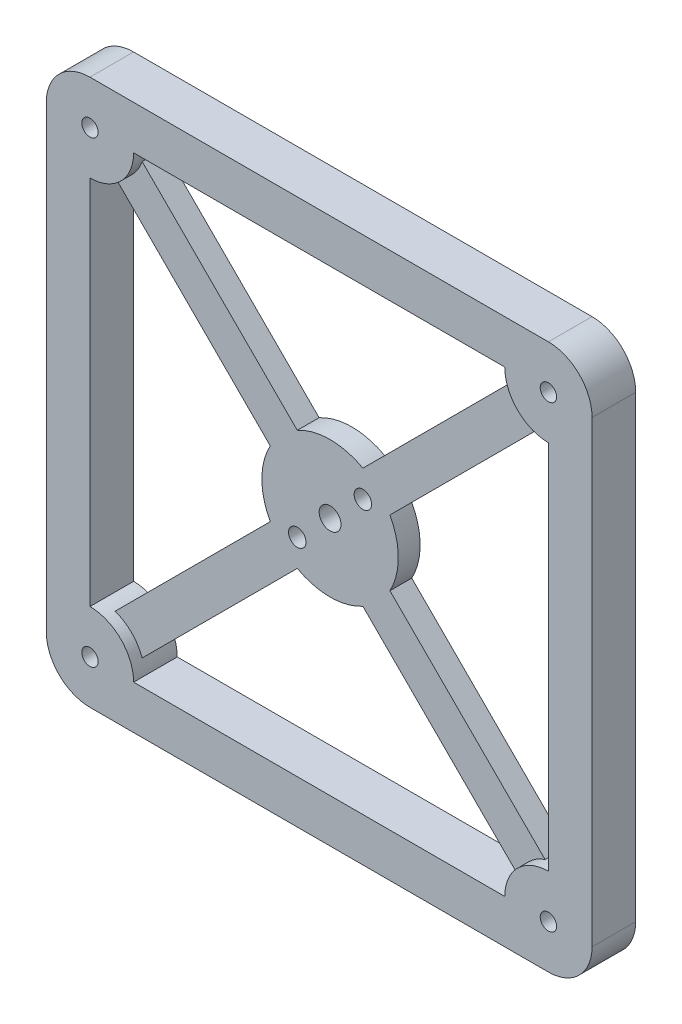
ISO-10303-21;
HEADER;
FILE_DESCRIPTION(('STEP AP214'),'2;1');
FILE_NAME('part.step','',(''),(''),'','','');
FILE_SCHEMA(('AUTOMOTIVE_DESIGN { 1 0 10303 214 1 1 1 1 }'));
ENDSEC;
DATA;
#1=APPLICATION_CONTEXT('core data for automotive mechanical design processes');
#2=APPLICATION_PROTOCOL_DEFINITION('international standard','automotive_design',2000,#1);
#3=PRODUCT_CONTEXT('',#1,'mechanical');
#4=PRODUCT('Part','Part','',(#3));
#5=PRODUCT_RELATED_PRODUCT_CATEGORY('part','',(#4));
#6=PRODUCT_DEFINITION_FORMATION('','',#4);
#7=PRODUCT_DEFINITION_CONTEXT('part definition',#1,'design');
#8=PRODUCT_DEFINITION('design','',#6,#7);
#9=PRODUCT_DEFINITION_SHAPE('','',#8);
#10=(LENGTH_UNIT() NAMED_UNIT(*) SI_UNIT(.MILLI.,.METRE.));
#11=(NAMED_UNIT(*) PLANE_ANGLE_UNIT() SI_UNIT($,.RADIAN.));
#12=(NAMED_UNIT(*) SI_UNIT($,.STERADIAN.) SOLID_ANGLE_UNIT());
#13=UNCERTAINTY_MEASURE_WITH_UNIT(LENGTH_MEASURE(1.E-05),#10,'distance_accuracy_value','');
#14=(GEOMETRIC_REPRESENTATION_CONTEXT(3) GLOBAL_UNCERTAINTY_ASSIGNED_CONTEXT((#13)) GLOBAL_UNIT_ASSIGNED_CONTEXT((#10,
#11,#12)) REPRESENTATION_CONTEXT('',''));
#15=CARTESIAN_POINT('',(0.,0.,0.));
#16=DIRECTION('',(0.,0.,1.));
#17=DIRECTION('',(1.,0.,0.));
#18=AXIS2_PLACEMENT_3D('',#15,#16,#17);
#19=CARTESIAN_POINT('',(-6.01040764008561,-6.01040764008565,8.));
#20=DIRECTION('',(0.,0.,-1.));
#21=DIRECTION('',(-1.,0.,0.));
#22=AXIS2_PLACEMENT_3D('',#19,#20,#21);
#23=CYLINDRICAL_SURFACE('',#22,1.59999999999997);
#24=CARTESIAN_POINT('',(-6.01040764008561,-6.01040764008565,2.));
#25=DIRECTION('',(0.,0.,-1.));
#26=DIRECTION('',(-1.,0.,0.));
#27=AXIS2_PLACEMENT_3D('',#24,#25,#26);
#28=CIRCLE('',#27,1.59999999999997);
#29=CARTESIAN_POINT('',(-7.61040764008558,-6.01040764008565,2.));
#30=VERTEX_POINT('',#29);
#31=EDGE_CURVE('E1020',#30,#30,#28,.F.);
#32=ORIENTED_EDGE('',*,*,#31,.F.);
#33=EDGE_LOOP('',(#32));
#34=FACE_BOUND('',#33,.T.);
#35=CARTESIAN_POINT('',(-6.01040764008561,-6.01040764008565,6.));
#36=DIRECTION('',(0.,0.,-1.));
#37=DIRECTION('',(-1.,0.,0.));
#38=AXIS2_PLACEMENT_3D('',#35,#36,#37);
#39=CIRCLE('',#38,1.59999999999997);
#40=CARTESIAN_POINT('',(-7.61040764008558,-6.01040764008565,6.));
#41=VERTEX_POINT('',#40);
#42=EDGE_CURVE('E1140',#41,#41,#39,.F.);
#43=ORIENTED_EDGE('',*,*,#42,.T.);
#44=EDGE_LOOP('',(#43));
#45=FACE_BOUND('',#44,.T.);
#46=ADVANCED_FACE('F181',(#34,#45),#23,.F.);
#47=CARTESIAN_POINT('',(0.,0.,8.));
#48=DIRECTION('',(0.,0.,-1.));
#49=DIRECTION('',(-1.,0.,0.));
#50=AXIS2_PLACEMENT_3D('',#47,#48,#49);
#51=CYLINDRICAL_SURFACE('',#50,2.);
#52=CARTESIAN_POINT('',(0.,0.,2.));
#53=DIRECTION('',(0.,0.,-1.));
#54=DIRECTION('',(-1.,0.,0.));
#55=AXIS2_PLACEMENT_3D('',#52,#53,#54);
#56=CIRCLE('',#55,2.);
#57=CARTESIAN_POINT('',(-1.99999999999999,0.,2.));
#58=VERTEX_POINT('',#57);
#59=EDGE_CURVE('E1023',#58,#58,#56,.F.);
#60=ORIENTED_EDGE('',*,*,#59,.F.);
#61=EDGE_LOOP('',(#60));
#62=FACE_BOUND('',#61,.T.);
#63=CARTESIAN_POINT('',(0.,0.,6.));
#64=DIRECTION('',(0.,0.,-1.));
#65=DIRECTION('',(-1.,0.,0.));
#66=AXIS2_PLACEMENT_3D('',#63,#64,#65);
#67=CIRCLE('',#66,2.);
#68=CARTESIAN_POINT('',(-1.99999999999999,0.,6.));
#69=VERTEX_POINT('',#68);
#70=EDGE_CURVE('E1143',#69,#69,#67,.F.);
#71=ORIENTED_EDGE('',*,*,#70,.T.);
#72=EDGE_LOOP('',(#71));
#73=FACE_BOUND('',#72,.T.);
#74=ADVANCED_FACE('F552',(#62,#73),#51,.F.);
#75=CARTESIAN_POINT('',(6.01040764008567,6.01040764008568,8.));
#76=DIRECTION('',(0.,0.,-1.));
#77=DIRECTION('',(-1.,0.,0.));
#78=AXIS2_PLACEMENT_3D('',#75,#76,#77);
#79=CYLINDRICAL_SURFACE('',#78,1.59999999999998);
#80=CARTESIAN_POINT('',(6.01040764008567,6.01040764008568,2.));
#81=DIRECTION('',(0.,0.,-1.));
#82=DIRECTION('',(-1.,0.,0.));
#83=AXIS2_PLACEMENT_3D('',#80,#81,#82);
#84=CIRCLE('',#83,1.59999999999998);
#85=CARTESIAN_POINT('',(4.41040764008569,6.01040764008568,2.));
#86=VERTEX_POINT('',#85);
#87=EDGE_CURVE('E981',#86,#86,#84,.F.);
#88=ORIENTED_EDGE('',*,*,#87,.F.);
#89=EDGE_LOOP('',(#88));
#90=FACE_BOUND('',#89,.T.);
#91=CARTESIAN_POINT('',(6.01040764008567,6.01040764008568,6.));
#92=DIRECTION('',(0.,0.,-1.));
#93=DIRECTION('',(-1.,0.,0.));
#94=AXIS2_PLACEMENT_3D('',#91,#92,#93);
#95=CIRCLE('',#94,1.59999999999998);
#96=CARTESIAN_POINT('',(4.41040764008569,6.01040764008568,6.));
#97=VERTEX_POINT('',#96);
#98=EDGE_CURVE('E1137',#97,#97,#95,.F.);
#99=ORIENTED_EDGE('',*,*,#98,.T.);
#100=EDGE_LOOP('',(#99));
#101=FACE_BOUND('',#100,.T.);
#102=ADVANCED_FACE('F558',(#90,#101),#79,.F.);
#103=CARTESIAN_POINT('',(2.47487373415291,-2.47487373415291,8.));
#104=DIRECTION('',(0.707106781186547,-0.707106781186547,0.));
#105=DIRECTION('',(0.707106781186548,0.707106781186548,0.));
#106=AXIS2_PLACEMENT_3D('',#103,#104,#105);
#107=PLANE('',#106);
#108=DIRECTION('',(0.,0.,-1.));
#109=VECTOR('',#108,1.);
#110=CARTESIAN_POINT('',(39.388126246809,34.4383787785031,8.));
#111=LINE('',#110,#109);
#112=CARTESIAN_POINT('',(39.388126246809,34.4383787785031,6.));
#113=VERTEX_POINT('',#112);
#114=CARTESIAN_POINT('',(39.388126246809,34.4383787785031,2.));
#115=VERTEX_POINT('',#114);
#116=EDGE_CURVE('E441',#113,#115,#111,.T.);
#117=ORIENTED_EDGE('',*,*,#116,.F.);
#118=DIRECTION('',(-0.707106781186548,-0.707106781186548,0.));
#119=VECTOR('',#118,1.);
#120=CARTESIAN_POINT('',(2.47487373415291,-2.47487373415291,6.));
#121=LINE('',#120,#119);
#122=CARTESIAN_POINT('',(10.9601551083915,6.01040764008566,6.));
#123=VERTEX_POINT('',#122);
#124=EDGE_CURVE('E396',#113,#123,#121,.T.);
#125=ORIENTED_EDGE('',*,*,#124,.T.);
#126=DIRECTION('',(0.,0.,-1.));
#127=VECTOR('',#126,1.);
#128=CARTESIAN_POINT('',(10.9601551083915,6.01040764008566,8.));
#129=LINE('',#128,#127);
#130=CARTESIAN_POINT('',(10.9601551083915,6.01040764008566,2.));
#131=VERTEX_POINT('',#130);
#132=EDGE_CURVE('E443',#123,#131,#129,.T.);
#133=ORIENTED_EDGE('',*,*,#132,.T.);
#134=DIRECTION('',(-0.707106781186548,-0.707106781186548,0.));
#135=VECTOR('',#134,1.);
#136=CARTESIAN_POINT('',(2.47487373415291,-2.47487373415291,2.));
#137=LINE('',#136,#135);
#138=EDGE_CURVE('E991',#115,#131,#137,.T.);
#139=ORIENTED_EDGE('',*,*,#138,.F.);
#140=EDGE_LOOP('',(#117,#125,#133,#139));
#141=FACE_BOUND('',#140,.T.);
#142=ADVANCED_FACE('F722',(#141),#107,.T.);
#143=CARTESIAN_POINT('',(0.,0.,8.));
#144=DIRECTION('',(0.,0.,-1.));
#145=DIRECTION('',(-1.,0.,0.));
#146=AXIS2_PLACEMENT_3D('',#143,#144,#145);
#147=CYLINDRICAL_SURFACE('',#146,12.5);
#148=ORIENTED_EDGE('',*,*,#132,.F.);
#149=CARTESIAN_POINT('',(0.,0.,6.));
#150=DIRECTION('',(0.,0.,-1.));
#151=DIRECTION('',(-1.,0.,0.));
#152=AXIS2_PLACEMENT_3D('',#149,#150,#151);
#153=CIRCLE('',#152,12.5);
#154=CARTESIAN_POINT('',(10.9601551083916,-6.01040764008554,6.));
#155=VERTEX_POINT('',#154);
#156=EDGE_CURVE('E1135',#123,#155,#153,.T.);
#157=ORIENTED_EDGE('',*,*,#156,.T.);
#158=DIRECTION('',(0.,0.,-1.));
#159=VECTOR('',#158,1.);
#160=CARTESIAN_POINT('',(10.9601551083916,-6.01040764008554,8.));
#161=LINE('',#160,#159);
#162=CARTESIAN_POINT('',(10.9601551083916,-6.01040764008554,2.));
#163=VERTEX_POINT('',#162);
#164=EDGE_CURVE('E445',#155,#163,#161,.T.);
#165=ORIENTED_EDGE('',*,*,#164,.T.);
#166=CARTESIAN_POINT('',(0.,0.,2.));
#167=DIRECTION('',(0.,0.,-1.));
#168=DIRECTION('',(-1.,0.,0.));
#169=AXIS2_PLACEMENT_3D('',#166,#167,#168);
#170=CIRCLE('',#169,12.5);
#171=EDGE_CURVE('E980',#131,#163,#170,.T.);
#172=ORIENTED_EDGE('',*,*,#171,.F.);
#173=EDGE_LOOP('',(#148,#157,#165,#172));
#174=FACE_BOUND('',#173,.T.);
#175=ADVANCED_FACE('F731',(#174),#147,.T.);
#176=CARTESIAN_POINT('',(2.47487373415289,2.47487373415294,8.));
#177=DIRECTION('',(0.70710678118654,0.707106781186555,0.));
#178=DIRECTION('',(-0.707106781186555,0.70710678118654,0.));
#179=AXIS2_PLACEMENT_3D('',#176,#177,#178);
#180=PLANE('',#179);
#181=ORIENTED_EDGE('',*,*,#164,.F.);
#182=DIRECTION('',(0.707106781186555,-0.70710678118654,0.));
#183=VECTOR('',#182,1.);
#184=CARTESIAN_POINT('',(2.47487373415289,2.47487373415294,6.));
#185=LINE('',#184,#183);
#186=CARTESIAN_POINT('',(39.3881262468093,-34.4383787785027,6.));
#187=VERTEX_POINT('',#186);
#188=EDGE_CURVE('E1132',#155,#187,#185,.T.);
#189=ORIENTED_EDGE('',*,*,#188,.T.);
#190=DIRECTION('',(0.,0.,-1.));
#191=VECTOR('',#190,1.);
#192=CARTESIAN_POINT('',(39.3881262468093,-34.4383787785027,8.));
#193=LINE('',#192,#191);
#194=CARTESIAN_POINT('',(39.3881262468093,-34.4383787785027,2.));
#195=VERTEX_POINT('',#194);
#196=EDGE_CURVE('E429',#187,#195,#193,.T.);
#197=ORIENTED_EDGE('',*,*,#196,.T.);
#198=DIRECTION('',(0.707106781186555,-0.70710678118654,0.));
#199=VECTOR('',#198,1.);
#200=CARTESIAN_POINT('',(2.47487373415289,2.47487373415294,2.));
#201=LINE('',#200,#199);
#202=EDGE_CURVE('E990',#163,#195,#201,.T.);
#203=ORIENTED_EDGE('',*,*,#202,.F.);
#204=EDGE_LOOP('',(#181,#189,#197,#203));
#205=FACE_BOUND('',#204,.T.);
#206=ADVANCED_FACE('F741',(#205),#180,.T.);
#207=CARTESIAN_POINT('',(-2.47487373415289,-2.47487373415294,8.));
#208=DIRECTION('',(-0.70710678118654,-0.707106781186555,0.));
#209=DIRECTION('',(0.707106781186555,-0.70710678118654,0.));
#210=AXIS2_PLACEMENT_3D('',#207,#208,#209);
#211=PLANE('',#210);
#212=DIRECTION('',(0.,0.,-1.));
#213=VECTOR('',#212,1.);
#214=CARTESIAN_POINT('',(34.4383787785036,-39.3881262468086,8.));
#215=LINE('',#214,#213);
#216=CARTESIAN_POINT('',(34.4383787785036,-39.3881262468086,6.));
#217=VERTEX_POINT('',#216);
#218=CARTESIAN_POINT('',(34.4383787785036,-39.3881262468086,2.));
#219=VERTEX_POINT('',#218);
#220=EDGE_CURVE('E1060',#217,#219,#215,.T.);
#221=ORIENTED_EDGE('',*,*,#220,.F.);
#222=DIRECTION('',(-0.707106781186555,0.70710678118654,0.));
#223=VECTOR('',#222,1.);
#224=CARTESIAN_POINT('',(-2.47487373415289,-2.47487373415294,6.));
#225=LINE('',#224,#223);
#226=CARTESIAN_POINT('',(6.01040764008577,-10.9601551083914,6.));
#227=VERTEX_POINT('',#226);
#228=EDGE_CURVE('E1127',#217,#227,#225,.T.);
#229=ORIENTED_EDGE('',*,*,#228,.T.);
#230=DIRECTION('',(0.,0.,-1.));
#231=VECTOR('',#230,1.);
#232=CARTESIAN_POINT('',(6.01040764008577,-10.9601551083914,8.));
#233=LINE('',#232,#231);
#234=CARTESIAN_POINT('',(6.01040764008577,-10.9601551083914,2.));
#235=VERTEX_POINT('',#234);
#236=EDGE_CURVE('E1063',#227,#235,#233,.T.);
#237=ORIENTED_EDGE('',*,*,#236,.T.);
#238=DIRECTION('',(-0.707106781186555,0.70710678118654,0.));
#239=VECTOR('',#238,1.);
#240=CARTESIAN_POINT('',(-2.47487373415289,-2.47487373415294,2.));
#241=LINE('',#240,#239);
#242=EDGE_CURVE('E999',#219,#235,#241,.T.);
#243=ORIENTED_EDGE('',*,*,#242,.F.);
#244=EDGE_LOOP('',(#221,#229,#237,#243));
#245=FACE_BOUND('',#244,.T.);
#246=ADVANCED_FACE('F751',(#245),#211,.T.);
#247=CARTESIAN_POINT('',(0.,0.,8.));
#248=DIRECTION('',(0.,0.,-1.));
#249=DIRECTION('',(-1.,0.,0.));
#250=AXIS2_PLACEMENT_3D('',#247,#248,#249);
#251=CYLINDRICAL_SURFACE('',#250,12.5);
#252=ORIENTED_EDGE('',*,*,#236,.F.);
#253=CARTESIAN_POINT('',(-6.01040764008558,-10.9601551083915,6.));
#254=VERTEX_POINT('',#253);
#255=EDGE_CURVE('E1121',#227,#254,#153,.T.);
#256=ORIENTED_EDGE('',*,*,#255,.T.);
#257=DIRECTION('',(0.,0.,-1.));
#258=VECTOR('',#257,1.);
#259=CARTESIAN_POINT('',(-6.01040764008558,-10.9601551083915,8.));
#260=LINE('',#259,#258);
#261=CARTESIAN_POINT('',(-6.01040764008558,-10.9601551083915,2.));
#262=VERTEX_POINT('',#261);
#263=EDGE_CURVE('E1065',#254,#262,#260,.T.);
#264=ORIENTED_EDGE('',*,*,#263,.T.);
#265=EDGE_CURVE('E988',#235,#262,#170,.T.);
#266=ORIENTED_EDGE('',*,*,#265,.F.);
#267=EDGE_LOOP('',(#252,#256,#264,#266));
#268=FACE_BOUND('',#267,.T.);
#269=ADVANCED_FACE('F761',(#268),#251,.T.);
#270=CARTESIAN_POINT('',(2.47487373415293,-2.4748737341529,8.));
#271=DIRECTION('',(0.707106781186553,-0.707106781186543,0.));
#272=DIRECTION('',(0.707106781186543,0.707106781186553,0.));
#273=AXIS2_PLACEMENT_3D('',#270,#271,#272);
#274=PLANE('',#273);
#275=ORIENTED_EDGE('',*,*,#263,.F.);
#276=DIRECTION('',(-0.707106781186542,-0.707106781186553,0.));
#277=VECTOR('',#276,1.);
#278=CARTESIAN_POINT('',(2.47487373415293,-2.4748737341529,6.));
#279=LINE('',#278,#277);
#280=CARTESIAN_POINT('',(-34.4383787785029,-39.3881262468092,6.));
#281=VERTEX_POINT('',#280);
#282=EDGE_CURVE('E1117',#254,#281,#279,.T.);
#283=ORIENTED_EDGE('',*,*,#282,.T.);
#284=DIRECTION('',(0.,0.,-1.));
#285=VECTOR('',#284,1.);
#286=CARTESIAN_POINT('',(-34.4383787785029,-39.3881262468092,8.));
#287=LINE('',#286,#285);
#288=CARTESIAN_POINT('',(-34.4383787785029,-39.3881262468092,2.));
#289=VERTEX_POINT('',#288);
#290=EDGE_CURVE('E1067',#281,#289,#287,.T.);
#291=ORIENTED_EDGE('',*,*,#290,.T.);
#292=DIRECTION('',(-0.707106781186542,-0.707106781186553,0.));
#293=VECTOR('',#292,1.);
#294=CARTESIAN_POINT('',(2.47487373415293,-2.4748737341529,2.));
#295=LINE('',#294,#293);
#296=EDGE_CURVE('E998',#262,#289,#295,.T.);
#297=ORIENTED_EDGE('',*,*,#296,.F.);
#298=EDGE_LOOP('',(#275,#283,#291,#297));
#299=FACE_BOUND('',#298,.T.);
#300=ADVANCED_FACE('F771',(#299),#274,.T.);
#301=CARTESIAN_POINT('',(2.4748737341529,2.47487373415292,8.));
#302=DIRECTION('',(0.707106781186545,0.70710678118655,0.));
#303=DIRECTION('',(-0.70710678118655,0.707106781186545,0.));
#304=AXIS2_PLACEMENT_3D('',#301,#302,#303);
#305=PLANE('',#304);
#306=DIRECTION('',(0.,0.,-1.));
#307=VECTOR('',#306,1.);
#308=CARTESIAN_POINT('',(-34.4383787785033,39.3881262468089,8.));
#309=LINE('',#308,#307);
#310=CARTESIAN_POINT('',(-34.4383787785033,39.3881262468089,6.));
#311=VERTEX_POINT('',#310);
#312=CARTESIAN_POINT('',(-34.4383787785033,39.3881262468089,2.));
#313=VERTEX_POINT('',#312);
#314=EDGE_CURVE('E433',#311,#313,#309,.T.);
#315=ORIENTED_EDGE('',*,*,#314,.F.);
#316=DIRECTION('',(0.70710678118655,-0.707106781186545,0.));
#317=VECTOR('',#316,1.);
#318=CARTESIAN_POINT('',(2.4748737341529,2.47487373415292,6.));
#319=LINE('',#318,#317);
#320=CARTESIAN_POINT('',(-6.0104076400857,10.9601551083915,6.));
#321=VERTEX_POINT('',#320);
#322=EDGE_CURVE('E969',#311,#321,#319,.T.);
#323=ORIENTED_EDGE('',*,*,#322,.T.);
#324=DIRECTION('',(0.,0.,-1.));
#325=VECTOR('',#324,1.);
#326=CARTESIAN_POINT('',(-6.0104076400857,10.9601551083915,8.));
#327=LINE('',#326,#325);
#328=CARTESIAN_POINT('',(-6.0104076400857,10.9601551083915,2.));
#329=VERTEX_POINT('',#328);
#330=EDGE_CURVE('E417',#321,#329,#327,.T.);
#331=ORIENTED_EDGE('',*,*,#330,.T.);
#332=DIRECTION('',(0.70710678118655,-0.707106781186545,0.));
#333=VECTOR('',#332,1.);
#334=CARTESIAN_POINT('',(2.4748737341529,2.47487373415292,2.));
#335=LINE('',#334,#333);
#336=EDGE_CURVE('E968',#313,#329,#335,.T.);
#337=ORIENTED_EDGE('',*,*,#336,.F.);
#338=EDGE_LOOP('',(#315,#323,#331,#337));
#339=FACE_BOUND('',#338,.T.);
#340=ADVANCED_FACE('F781',(#339),#305,.T.);
#341=CARTESIAN_POINT('',(0.,0.,8.));
#342=DIRECTION('',(0.,0.,-1.));
#343=DIRECTION('',(-1.,0.,0.));
#344=AXIS2_PLACEMENT_3D('',#341,#342,#343);
#345=CYLINDRICAL_SURFACE('',#344,12.5);
#346=ORIENTED_EDGE('',*,*,#330,.F.);
#347=CARTESIAN_POINT('',(6.01040764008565,10.9601551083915,6.));
#348=VERTEX_POINT('',#347);
#349=EDGE_CURVE('E408',#321,#348,#153,.T.);
#350=ORIENTED_EDGE('',*,*,#349,.T.);
#351=DIRECTION('',(0.,0.,-1.));
#352=VECTOR('',#351,1.);
#353=CARTESIAN_POINT('',(6.01040764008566,10.9601551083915,8.));
#354=LINE('',#353,#352);
#355=CARTESIAN_POINT('',(6.01040764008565,10.9601551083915,2.));
#356=VERTEX_POINT('',#355);
#357=EDGE_CURVE('E407',#348,#356,#354,.T.);
#358=ORIENTED_EDGE('',*,*,#357,.T.);
#359=EDGE_CURVE('E974',#329,#356,#170,.T.);
#360=ORIENTED_EDGE('',*,*,#359,.F.);
#361=EDGE_LOOP('',(#346,#350,#358,#360));
#362=FACE_BOUND('',#361,.T.);
#363=ADVANCED_FACE('F791',(#362),#345,.T.);
#364=CARTESIAN_POINT('',(-2.47487373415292,2.47487373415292,8.));
#365=DIRECTION('',(-0.707106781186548,0.707106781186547,0.));
#366=DIRECTION('',(-0.707106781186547,-0.707106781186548,0.));
#367=AXIS2_PLACEMENT_3D('',#364,#365,#366);
#368=PLANE('',#367);
#369=ORIENTED_EDGE('',*,*,#357,.F.);
#370=DIRECTION('',(0.707106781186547,0.707106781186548,0.));
#371=VECTOR('',#370,1.);
#372=CARTESIAN_POINT('',(-2.47487373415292,2.47487373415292,6.));
#373=LINE('',#372,#371);
#374=CARTESIAN_POINT('',(34.4383787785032,39.388126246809,6.));
#375=VERTEX_POINT('',#374);
#376=EDGE_CURVE('E393',#348,#375,#373,.T.);
#377=ORIENTED_EDGE('',*,*,#376,.T.);
#378=DIRECTION('',(0.,0.,-1.));
#379=VECTOR('',#378,1.);
#380=CARTESIAN_POINT('',(34.4383787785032,39.388126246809,8.));
#381=LINE('',#380,#379);
#382=CARTESIAN_POINT('',(34.4383787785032,39.388126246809,2.));
#383=VERTEX_POINT('',#382);
#384=EDGE_CURVE('E405',#375,#383,#381,.T.);
#385=ORIENTED_EDGE('',*,*,#384,.T.);
#386=DIRECTION('',(0.707106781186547,0.707106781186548,0.));
#387=VECTOR('',#386,1.);
#388=CARTESIAN_POINT('',(-2.47487373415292,2.47487373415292,2.));
#389=LINE('',#388,#387);
#390=EDGE_CURVE('E977',#356,#383,#389,.T.);
#391=ORIENTED_EDGE('',*,*,#390,.F.);
#392=EDGE_LOOP('',(#369,#377,#385,#391));
#393=FACE_BOUND('',#392,.T.);
#394=ADVANCED_FACE('F403',(#393),#368,.T.);
#395=CARTESIAN_POINT('',(-2.47487373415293,2.47487373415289,8.));
#396=DIRECTION('',(-0.707106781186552,0.707106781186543,0.));
#397=DIRECTION('',(-0.707106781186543,-0.707106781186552,0.));
#398=AXIS2_PLACEMENT_3D('',#395,#396,#397);
#399=PLANE('',#398);
#400=DIRECTION('',(0.,0.,-1.));
#401=VECTOR('',#400,1.);
#402=CARTESIAN_POINT('',(-39.3881262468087,-34.4383787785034,8.));
#403=LINE('',#402,#401);
#404=CARTESIAN_POINT('',(-39.3881262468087,-34.4383787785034,6.));
#405=VERTEX_POINT('',#404);
#406=CARTESIAN_POINT('',(-39.3881262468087,-34.4383787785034,2.));
#407=VERTEX_POINT('',#406);
#408=EDGE_CURVE('E955',#405,#407,#403,.T.);
#409=ORIENTED_EDGE('',*,*,#408,.F.);
#410=DIRECTION('',(0.707106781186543,0.707106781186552,0.));
#411=VECTOR('',#410,1.);
#412=CARTESIAN_POINT('',(-2.47487373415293,2.47487373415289,6.));
#413=LINE('',#412,#411);
#414=CARTESIAN_POINT('',(-10.9601551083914,-6.01040764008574,6.));
#415=VERTEX_POINT('',#414);
#416=EDGE_CURVE('E1113',#405,#415,#413,.T.);
#417=ORIENTED_EDGE('',*,*,#416,.T.);
#418=DIRECTION('',(0.,0.,-1.));
#419=VECTOR('',#418,1.);
#420=CARTESIAN_POINT('',(-10.9601551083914,-6.01040764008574,8.));
#421=LINE('',#420,#419);
#422=CARTESIAN_POINT('',(-10.9601551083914,-6.01040764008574,2.));
#423=VERTEX_POINT('',#422);
#424=EDGE_CURVE('E958',#415,#423,#421,.T.);
#425=ORIENTED_EDGE('',*,*,#424,.T.);
#426=DIRECTION('',(0.707106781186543,0.707106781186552,0.));
#427=VECTOR('',#426,1.);
#428=CARTESIAN_POINT('',(-2.47487373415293,2.47487373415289,2.));
#429=LINE('',#428,#427);
#430=EDGE_CURVE('E987',#407,#423,#429,.T.);
#431=ORIENTED_EDGE('',*,*,#430,.F.);
#432=EDGE_LOOP('',(#409,#417,#425,#431));
#433=FACE_BOUND('',#432,.T.);
#434=ADVANCED_FACE('F810',(#433),#399,.T.);
#435=CARTESIAN_POINT('',(0.,0.,8.));
#436=DIRECTION('',(0.,0.,-1.));
#437=DIRECTION('',(-1.,0.,0.));
#438=AXIS2_PLACEMENT_3D('',#435,#436,#437);
#439=CYLINDRICAL_SURFACE('',#438,12.5);
#440=ORIENTED_EDGE('',*,*,#424,.F.);
#441=CARTESIAN_POINT('',(-10.9601551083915,6.01040764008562,6.));
#442=VERTEX_POINT('',#441);
#443=EDGE_CURVE('E1108',#415,#442,#153,.T.);
#444=ORIENTED_EDGE('',*,*,#443,.T.);
#445=DIRECTION('',(0.,0.,-1.));
#446=VECTOR('',#445,1.);
#447=CARTESIAN_POINT('',(-10.9601551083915,6.01040764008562,8.));
#448=LINE('',#447,#446);
#449=CARTESIAN_POINT('',(-10.9601551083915,6.01040764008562,2.));
#450=VERTEX_POINT('',#449);
#451=EDGE_CURVE('E1083',#442,#450,#448,.T.);
#452=ORIENTED_EDGE('',*,*,#451,.T.);
#453=EDGE_CURVE('E979',#423,#450,#170,.T.);
#454=ORIENTED_EDGE('',*,*,#453,.F.);
#455=EDGE_LOOP('',(#440,#444,#452,#454));
#456=FACE_BOUND('',#455,.T.);
#457=ADVANCED_FACE('F819',(#456),#439,.T.);
#458=CARTESIAN_POINT('',(-2.4748737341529,-2.47487373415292,8.));
#459=DIRECTION('',(-0.707106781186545,-0.70710678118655,0.));
#460=DIRECTION('',(0.70710678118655,-0.707106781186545,0.));
#461=AXIS2_PLACEMENT_3D('',#458,#459,#460);
#462=PLANE('',#461);
#463=ORIENTED_EDGE('',*,*,#451,.F.);
#464=DIRECTION('',(-0.70710678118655,0.707106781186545,0.));
#465=VECTOR('',#464,1.);
#466=CARTESIAN_POINT('',(-2.4748737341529,-2.47487373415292,6.));
#467=LINE('',#466,#465);
#468=CARTESIAN_POINT('',(-39.3881262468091,34.438378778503,6.));
#469=VERTEX_POINT('',#468);
#470=EDGE_CURVE('E1119',#442,#469,#467,.T.);
#471=ORIENTED_EDGE('',*,*,#470,.T.);
#472=DIRECTION('',(0.,0.,-1.));
#473=VECTOR('',#472,1.);
#474=CARTESIAN_POINT('',(-39.3881262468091,34.438378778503,8.));
#475=LINE('',#474,#473);
#476=CARTESIAN_POINT('',(-39.3881262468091,34.438378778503,2.));
#477=VERTEX_POINT('',#476);
#478=EDGE_CURVE('E203',#469,#477,#475,.T.);
#479=ORIENTED_EDGE('',*,*,#478,.T.);
#480=DIRECTION('',(-0.70710678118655,0.707106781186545,0.));
#481=VECTOR('',#480,1.);
#482=CARTESIAN_POINT('',(-2.4748737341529,-2.47487373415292,2.));
#483=LINE('',#482,#481);
#484=EDGE_CURVE('E986',#450,#477,#483,.T.);
#485=ORIENTED_EDGE('',*,*,#484,.F.);
#486=EDGE_LOOP('',(#463,#471,#479,#485));
#487=FACE_BOUND('',#486,.T.);
#488=ADVANCED_FACE('F570',(#487),#462,.T.);
#489=CARTESIAN_POINT('',(0.,0.,0.));
#490=DIRECTION('',(0.,0.,-1.));
#491=DIRECTION('',(-1.,0.,0.));
#492=AXIS2_PLACEMENT_3D('',#489,#490,#491);
#493=PLANE('',#492);
#494=DIRECTION('',(-1.,0.,0.));
#495=VECTOR('',#494,1.);
#496=CARTESIAN_POINT('',(50.,50.,0.));
#497=LINE('',#496,#495);
#498=CARTESIAN_POINT('',(42.,50.,0.));
#499=VERTEX_POINT('',#498);
#500=CARTESIAN_POINT('',(-42.,50.,0.));
#501=VERTEX_POINT('',#500);
#502=EDGE_CURVE('E467',#499,#501,#497,.T.);
#503=ORIENTED_EDGE('',*,*,#502,.F.);
#504=CARTESIAN_POINT('',(42.,42.,0.));
#505=DIRECTION('',(0.,0.,-1.));
#506=DIRECTION('',(-1.,0.,0.));
#507=AXIS2_PLACEMENT_3D('',#504,#505,#506);
#508=CIRCLE('',#507,8.);
#509=CARTESIAN_POINT('',(50.,42.,0.));
#510=VERTEX_POINT('',#509);
#511=EDGE_CURVE('E482',#499,#510,#508,.T.);
#512=ORIENTED_EDGE('',*,*,#511,.T.);
#513=DIRECTION('',(0.,1.,0.));
#514=VECTOR('',#513,1.);
#515=CARTESIAN_POINT('',(50.,-50.,0.));
#516=LINE('',#515,#514);
#517=CARTESIAN_POINT('',(50.,-42.,0.));
#518=VERTEX_POINT('',#517);
#519=EDGE_CURVE('E452',#518,#510,#516,.T.);
#520=ORIENTED_EDGE('',*,*,#519,.F.);
#521=CARTESIAN_POINT('',(42.,-42.,0.));
#522=DIRECTION('',(0.,0.,-1.));
#523=DIRECTION('',(-1.,0.,0.));
#524=AXIS2_PLACEMENT_3D('',#521,#522,#523);
#525=CIRCLE('',#524,8.);
#526=CARTESIAN_POINT('',(42.,-50.,0.));
#527=VERTEX_POINT('',#526);
#528=EDGE_CURVE('E480',#518,#527,#525,.T.);
#529=ORIENTED_EDGE('',*,*,#528,.T.);
#530=DIRECTION('',(-1.,0.,0.));
#531=VECTOR('',#530,1.);
#532=CARTESIAN_POINT('',(50.,-50.,0.));
#533=LINE('',#532,#531);
#534=CARTESIAN_POINT('',(-42.,-50.,0.));
#535=VERTEX_POINT('',#534);
#536=EDGE_CURVE('E437',#527,#535,#533,.T.);
#537=ORIENTED_EDGE('',*,*,#536,.T.);
#538=CARTESIAN_POINT('',(-42.,-42.,0.));
#539=DIRECTION('',(0.,0.,-1.));
#540=DIRECTION('',(-1.,0.,0.));
#541=AXIS2_PLACEMENT_3D('',#538,#539,#540);
#542=CIRCLE('',#541,8.);
#543=CARTESIAN_POINT('',(-50.,-42.,0.));
#544=VERTEX_POINT('',#543);
#545=EDGE_CURVE('E478',#535,#544,#542,.T.);
#546=ORIENTED_EDGE('',*,*,#545,.T.);
#547=DIRECTION('',(0.,1.,0.));
#548=VECTOR('',#547,1.);
#549=CARTESIAN_POINT('',(-50.,-50.,0.));
#550=LINE('',#549,#548);
#551=CARTESIAN_POINT('',(-50.,42.,0.));
#552=VERTEX_POINT('',#551);
#553=EDGE_CURVE('E464',#544,#552,#550,.T.);
#554=ORIENTED_EDGE('',*,*,#553,.T.);
#555=CARTESIAN_POINT('',(-42.,42.,0.));
#556=DIRECTION('',(0.,0.,-1.));
#557=DIRECTION('',(-1.,0.,0.));
#558=AXIS2_PLACEMENT_3D('',#555,#556,#557);
#559=CIRCLE('',#558,8.);
#560=EDGE_CURVE('E476',#552,#501,#559,.T.);
#561=ORIENTED_EDGE('',*,*,#560,.T.);
#562=EDGE_LOOP('',(#503,#512,#520,#529,#537,#546,#554,#561));
#563=FACE_BOUND('',#562,.T.);
#564=CARTESIAN_POINT('',(42.,42.,0.));
#565=DIRECTION('',(0.,0.,-1.));
#566=DIRECTION('',(-1.,0.,0.));
#567=AXIS2_PLACEMENT_3D('',#564,#565,#566);
#568=CIRCLE('',#567,1.5);
#569=CARTESIAN_POINT('',(40.5,42.,0.));
#570=VERTEX_POINT('',#569);
#571=EDGE_CURVE('E1030',#570,#570,#568,.T.);
#572=ORIENTED_EDGE('',*,*,#571,.F.);
#573=EDGE_LOOP('',(#572));
#574=FACE_BOUND('',#573,.T.);
#575=CARTESIAN_POINT('',(-42.0000000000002,41.9999999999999,0.));
#576=DIRECTION('',(0.,0.,-1.));
#577=DIRECTION('',(-1.,0.,0.));
#578=AXIS2_PLACEMENT_3D('',#575,#576,#577);
#579=CIRCLE('',#578,1.5);
#580=CARTESIAN_POINT('',(-43.5000000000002,41.9999999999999,0.));
#581=VERTEX_POINT('',#580);
#582=EDGE_CURVE('E1027',#581,#581,#579,.T.);
#583=ORIENTED_EDGE('',*,*,#582,.F.);
#584=EDGE_LOOP('',(#583));
#585=FACE_BOUND('',#584,.T.);
#586=CARTESIAN_POINT('',(-41.9999999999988,-41.9999999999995,0.));
#587=DIRECTION('',(0.,0.,-1.));
#588=DIRECTION('',(-1.,0.,0.));
#589=AXIS2_PLACEMENT_3D('',#586,#587,#588);
#590=CIRCLE('',#589,1.5);
#591=CARTESIAN_POINT('',(-43.4999999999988,-41.9999999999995,0.));
#592=VERTEX_POINT('',#591);
#593=EDGE_CURVE('E1034',#592,#592,#590,.T.);
#594=ORIENTED_EDGE('',*,*,#593,.F.);
#595=EDGE_LOOP('',(#594));
#596=FACE_BOUND('',#595,.T.);
#597=CARTESIAN_POINT('',(42.0000000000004,-41.9999999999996,0.));
#598=DIRECTION('',(0.,0.,-1.));
#599=DIRECTION('',(-1.,0.,0.));
#600=AXIS2_PLACEMENT_3D('',#597,#598,#599);
#601=CIRCLE('',#600,1.5);
#602=CARTESIAN_POINT('',(40.5000000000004,-41.9999999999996,0.));
#603=VERTEX_POINT('',#602);
#604=EDGE_CURVE('E1040',#603,#603,#601,.T.);
#605=ORIENTED_EDGE('',*,*,#604,.F.);
#606=EDGE_LOOP('',(#605));
#607=FACE_BOUND('',#606,.T.);
#608=DIRECTION('',(0.,1.,0.));
#609=VECTOR('',#608,1.);
#610=CARTESIAN_POINT('',(42.0000000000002,2.70004606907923E-13,0.));
#611=LINE('',#610,#609);
#612=CARTESIAN_POINT('',(42.0000000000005,-33.9999999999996,0.));
#613=VERTEX_POINT('',#612);
#614=CARTESIAN_POINT('',(42.,34.,0.));
#615=VERTEX_POINT('',#614);
#616=EDGE_CURVE('E430',#613,#615,#611,.T.);
#617=ORIENTED_EDGE('',*,*,#616,.T.);
#618=CARTESIAN_POINT('',(42.,42.,0.));
#619=DIRECTION('',(0.,0.,-1.));
#620=DIRECTION('',(-1.,0.,0.));
#621=AXIS2_PLACEMENT_3D('',#618,#619,#620);
#622=CIRCLE('',#621,8.);
#623=CARTESIAN_POINT('',(34.,42.,0.));
#624=VERTEX_POINT('',#623);
#625=EDGE_CURVE('E954',#615,#624,#622,.T.);
#626=ORIENTED_EDGE('',*,*,#625,.T.);
#627=DIRECTION('',(-1.,0.,0.));
#628=VECTOR('',#627,1.);
#629=CARTESIAN_POINT('',(0.,41.9999999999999,0.));
#630=LINE('',#629,#628);
#631=CARTESIAN_POINT('',(-34.0000000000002,41.9999999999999,0.));
#632=VERTEX_POINT('',#631);
#633=EDGE_CURVE('E950',#624,#632,#630,.T.);
#634=ORIENTED_EDGE('',*,*,#633,.T.);
#635=CARTESIAN_POINT('',(-42.0000000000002,41.9999999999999,0.));
#636=DIRECTION('',(0.,0.,-1.));
#637=DIRECTION('',(-1.,0.,0.));
#638=AXIS2_PLACEMENT_3D('',#635,#636,#637);
#639=CIRCLE('',#638,8.);
#640=CARTESIAN_POINT('',(-41.9999999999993,34.0000000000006,0.));
#641=VERTEX_POINT('',#640);
#642=EDGE_CURVE('E938',#632,#641,#639,.T.);
#643=ORIENTED_EDGE('',*,*,#642,.T.);
#644=DIRECTION('',(0.,-1.,0.));
#645=VECTOR('',#644,1.);
#646=CARTESIAN_POINT('',(-41.9999999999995,2.70004606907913E-13,0.));
#647=LINE('',#646,#645);
#648=CARTESIAN_POINT('',(-41.9999999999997,-34.0000000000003,0.));
#649=VERTEX_POINT('',#648);
#650=EDGE_CURVE('E946',#641,#649,#647,.T.);
#651=ORIENTED_EDGE('',*,*,#650,.T.);
#652=CARTESIAN_POINT('',(-41.9999999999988,-41.9999999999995,0.));
#653=DIRECTION('',(0.,0.,-1.));
#654=DIRECTION('',(-1.,0.,0.));
#655=AXIS2_PLACEMENT_3D('',#652,#653,#654);
#656=CIRCLE('',#655,7.99999999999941);
#657=CARTESIAN_POINT('',(-33.9999999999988,-41.9999999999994,0.));
#658=VERTEX_POINT('',#657);
#659=EDGE_CURVE('E1062',#649,#658,#656,.T.);
#660=ORIENTED_EDGE('',*,*,#659,.T.);
#661=DIRECTION('',(1.,0.,0.));
#662=VECTOR('',#661,1.);
#663=CARTESIAN_POINT('',(0.,-41.9999999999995,0.));
#664=LINE('',#663,#662);
#665=CARTESIAN_POINT('',(34.0000000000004,-41.9999999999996,0.));
#666=VERTEX_POINT('',#665);
#667=EDGE_CURVE('E1054',#658,#666,#664,.T.);
#668=ORIENTED_EDGE('',*,*,#667,.T.);
#669=CARTESIAN_POINT('',(42.0000000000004,-41.9999999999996,0.));
#670=DIRECTION('',(0.,0.,-1.));
#671=DIRECTION('',(-1.,0.,0.));
#672=AXIS2_PLACEMENT_3D('',#669,#670,#671);
#673=CIRCLE('',#672,8.);
#674=EDGE_CURVE('E1048',#666,#613,#673,.T.);
#675=ORIENTED_EDGE('',*,*,#674,.T.);
#676=EDGE_LOOP('',(#617,#626,#634,#643,#651,#660,#668,#675));
#677=FACE_BOUND('',#676,.T.);
#678=ADVANCED_FACE('F512',(#563,#574,#585,#596,#607,#677),#493,.T.);
#679=CARTESIAN_POINT('',(0.,0.,8.));
#680=DIRECTION('',(0.,0.,-1.));
#681=DIRECTION('',(-1.,0.,0.));
#682=AXIS2_PLACEMENT_3D('',#679,#680,#681);
#683=PLANE('',#682);
#684=CARTESIAN_POINT('',(42.0000000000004,-41.9999999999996,8.));
#685=DIRECTION('',(0.,0.,-1.));
#686=DIRECTION('',(-1.,0.,0.));
#687=AXIS2_PLACEMENT_3D('',#684,#685,#686);
#688=CIRCLE('',#687,1.5);
#689=CARTESIAN_POINT('',(40.5000000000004,-41.9999999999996,8.));
#690=VERTEX_POINT('',#689);
#691=EDGE_CURVE('E1026',#690,#690,#688,.T.);
#692=ORIENTED_EDGE('',*,*,#691,.T.);
#693=EDGE_LOOP('',(#692));
#694=FACE_BOUND('',#693,.T.);
#695=CARTESIAN_POINT('',(-41.9999999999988,-41.9999999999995,8.));
#696=DIRECTION('',(0.,0.,-1.));
#697=DIRECTION('',(-1.,0.,0.));
#698=AXIS2_PLACEMENT_3D('',#695,#696,#697);
#699=CIRCLE('',#698,1.5);
#700=CARTESIAN_POINT('',(-43.4999999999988,-41.9999999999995,8.));
#701=VERTEX_POINT('',#700);
#702=EDGE_CURVE('E1037',#701,#701,#699,.T.);
#703=ORIENTED_EDGE('',*,*,#702,.T.);
#704=EDGE_LOOP('',(#703));
#705=FACE_BOUND('',#704,.T.);
#706=CARTESIAN_POINT('',(-42.0000000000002,41.9999999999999,8.));
#707=DIRECTION('',(0.,0.,-1.));
#708=DIRECTION('',(-1.,0.,0.));
#709=AXIS2_PLACEMENT_3D('',#706,#707,#708);
#710=CIRCLE('',#709,1.5);
#711=CARTESIAN_POINT('',(-43.5000000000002,41.9999999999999,8.));
#712=VERTEX_POINT('',#711);
#713=EDGE_CURVE('E1031',#712,#712,#710,.T.);
#714=ORIENTED_EDGE('',*,*,#713,.T.);
#715=EDGE_LOOP('',(#714));
#716=FACE_BOUND('',#715,.T.);
#717=CARTESIAN_POINT('',(42.,42.,8.));
#718=DIRECTION('',(0.,0.,-1.));
#719=DIRECTION('',(-1.,0.,0.));
#720=AXIS2_PLACEMENT_3D('',#717,#718,#719);
#721=CIRCLE('',#720,1.5);
#722=CARTESIAN_POINT('',(40.5,42.,8.));
#723=VERTEX_POINT('',#722);
#724=EDGE_CURVE('E1045',#723,#723,#721,.T.);
#725=ORIENTED_EDGE('',*,*,#724,.T.);
#726=EDGE_LOOP('',(#725));
#727=FACE_BOUND('',#726,.T.);
#728=CARTESIAN_POINT('',(42.,42.,8.));
#729=DIRECTION('',(0.,0.,-1.));
#730=DIRECTION('',(-1.,0.,0.));
#731=AXIS2_PLACEMENT_3D('',#728,#729,#730);
#732=CIRCLE('',#731,8.);
#733=CARTESIAN_POINT('',(42.,34.,8.));
#734=VERTEX_POINT('',#733);
#735=CARTESIAN_POINT('',(34.,42.,8.));
#736=VERTEX_POINT('',#735);
#737=EDGE_CURVE('E425',#734,#736,#732,.T.);
#738=ORIENTED_EDGE('',*,*,#737,.F.);
#739=DIRECTION('',(0.,1.,0.));
#740=VECTOR('',#739,1.);
#741=CARTESIAN_POINT('',(42.0000000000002,2.70004606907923E-13,8.));
#742=LINE('',#741,#740);
#743=CARTESIAN_POINT('',(42.0000000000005,-33.9999999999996,8.));
#744=VERTEX_POINT('',#743);
#745=EDGE_CURVE('E426',#744,#734,#742,.T.);
#746=ORIENTED_EDGE('',*,*,#745,.F.);
#747=CARTESIAN_POINT('',(42.0000000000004,-41.9999999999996,8.));
#748=DIRECTION('',(0.,0.,-1.));
#749=DIRECTION('',(-1.,0.,0.));
#750=AXIS2_PLACEMENT_3D('',#747,#748,#749);
#751=CIRCLE('',#750,8.);
#752=CARTESIAN_POINT('',(34.0000000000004,-41.9999999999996,8.));
#753=VERTEX_POINT('',#752);
#754=EDGE_CURVE('E1051',#753,#744,#751,.T.);
#755=ORIENTED_EDGE('',*,*,#754,.F.);
#756=DIRECTION('',(1.,0.,0.));
#757=VECTOR('',#756,1.);
#758=CARTESIAN_POINT('',(0.,-41.9999999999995,8.));
#759=LINE('',#758,#757);
#760=CARTESIAN_POINT('',(-33.9999999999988,-41.9999999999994,8.));
#761=VERTEX_POINT('',#760);
#762=EDGE_CURVE('E1053',#761,#753,#759,.T.);
#763=ORIENTED_EDGE('',*,*,#762,.F.);
#764=CARTESIAN_POINT('',(-41.9999999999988,-41.9999999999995,8.));
#765=DIRECTION('',(0.,0.,-1.));
#766=DIRECTION('',(-1.,0.,0.));
#767=AXIS2_PLACEMENT_3D('',#764,#765,#766);
#768=CIRCLE('',#767,7.99999999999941);
#769=CARTESIAN_POINT('',(-41.9999999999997,-34.0000000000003,8.));
#770=VERTEX_POINT('',#769);
#771=EDGE_CURVE('E945',#770,#761,#768,.T.);
#772=ORIENTED_EDGE('',*,*,#771,.F.);
#773=DIRECTION('',(0.,-1.,0.));
#774=VECTOR('',#773,1.);
#775=CARTESIAN_POINT('',(-41.9999999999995,2.70004606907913E-13,8.));
#776=LINE('',#775,#774);
#777=CARTESIAN_POINT('',(-41.9999999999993,34.0000000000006,8.));
#778=VERTEX_POINT('',#777);
#779=EDGE_CURVE('E1075',#778,#770,#776,.T.);
#780=ORIENTED_EDGE('',*,*,#779,.F.);
#781=CARTESIAN_POINT('',(-42.0000000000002,41.9999999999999,8.));
#782=DIRECTION('',(0.,0.,-1.));
#783=DIRECTION('',(-1.,0.,0.));
#784=AXIS2_PLACEMENT_3D('',#781,#782,#783);
#785=CIRCLE('',#784,8.);
#786=CARTESIAN_POINT('',(-34.0000000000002,41.9999999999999,8.));
#787=VERTEX_POINT('',#786);
#788=EDGE_CURVE('E1077',#787,#778,#785,.T.);
#789=ORIENTED_EDGE('',*,*,#788,.F.);
#790=DIRECTION('',(-1.,0.,0.));
#791=VECTOR('',#790,1.);
#792=CARTESIAN_POINT('',(0.,41.9999999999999,8.));
#793=LINE('',#792,#791);
#794=EDGE_CURVE('E953',#736,#787,#793,.T.);
#795=ORIENTED_EDGE('',*,*,#794,.F.);
#796=EDGE_LOOP('',(#738,#746,#755,#763,#772,#780,#789,#795));
#797=FACE_BOUND('',#796,.T.);
#798=DIRECTION('',(0.,1.,0.));
#799=VECTOR('',#798,1.);
#800=CARTESIAN_POINT('',(50.,-50.,8.));
#801=LINE('',#800,#799);
#802=CARTESIAN_POINT('',(50.,-42.,8.));
#803=VERTEX_POINT('',#802);
#804=CARTESIAN_POINT('',(50.,42.,8.));
#805=VERTEX_POINT('',#804);
#806=EDGE_CURVE('E458',#803,#805,#801,.T.);
#807=ORIENTED_EDGE('',*,*,#806,.T.);
#808=CARTESIAN_POINT('',(42.,42.,8.));
#809=DIRECTION('',(0.,0.,-1.));
#810=DIRECTION('',(-1.,0.,0.));
#811=AXIS2_PLACEMENT_3D('',#808,#809,#810);
#812=CIRCLE('',#811,8.);
#813=CARTESIAN_POINT('',(42.,50.,8.));
#814=VERTEX_POINT('',#813);
#815=EDGE_CURVE('E495',#805,#814,#812,.F.);
#816=ORIENTED_EDGE('',*,*,#815,.T.);
#817=DIRECTION('',(-1.,0.,0.));
#818=VECTOR('',#817,1.);
#819=CARTESIAN_POINT('',(50.,50.,8.));
#820=LINE('',#819,#818);
#821=CARTESIAN_POINT('',(-42.,50.,8.));
#822=VERTEX_POINT('',#821);
#823=EDGE_CURVE('E455',#814,#822,#820,.T.);
#824=ORIENTED_EDGE('',*,*,#823,.T.);
#825=CARTESIAN_POINT('',(-42.,42.,8.));
#826=DIRECTION('',(0.,0.,-1.));
#827=DIRECTION('',(-1.,0.,0.));
#828=AXIS2_PLACEMENT_3D('',#825,#826,#827);
#829=CIRCLE('',#828,8.);
#830=CARTESIAN_POINT('',(-50.,42.,8.));
#831=VERTEX_POINT('',#830);
#832=EDGE_CURVE('E489',#822,#831,#829,.F.);
#833=ORIENTED_EDGE('',*,*,#832,.T.);
#834=DIRECTION('',(0.,1.,0.));
#835=VECTOR('',#834,1.);
#836=CARTESIAN_POINT('',(-50.,-50.,8.));
#837=LINE('',#836,#835);
#838=CARTESIAN_POINT('',(-50.,-42.,8.));
#839=VERTEX_POINT('',#838);
#840=EDGE_CURVE('E451',#839,#831,#837,.T.);
#841=ORIENTED_EDGE('',*,*,#840,.F.);
#842=CARTESIAN_POINT('',(-42.,-42.,8.));
#843=DIRECTION('',(0.,0.,-1.));
#844=DIRECTION('',(-1.,0.,0.));
#845=AXIS2_PLACEMENT_3D('',#842,#843,#844);
#846=CIRCLE('',#845,8.);
#847=CARTESIAN_POINT('',(-42.,-50.,8.));
#848=VERTEX_POINT('',#847);
#849=EDGE_CURVE('E491',#839,#848,#846,.F.);
#850=ORIENTED_EDGE('',*,*,#849,.T.);
#851=DIRECTION('',(-1.,0.,0.));
#852=VECTOR('',#851,1.);
#853=CARTESIAN_POINT('',(50.,-50.,8.));
#854=LINE('',#853,#852);
#855=CARTESIAN_POINT('',(42.,-50.,8.));
#856=VERTEX_POINT('',#855);
#857=EDGE_CURVE('E448',#856,#848,#854,.T.);
#858=ORIENTED_EDGE('',*,*,#857,.F.);
#859=CARTESIAN_POINT('',(42.,-42.,8.));
#860=DIRECTION('',(0.,0.,-1.));
#861=DIRECTION('',(-1.,0.,0.));
#862=AXIS2_PLACEMENT_3D('',#859,#860,#861);
#863=CIRCLE('',#862,8.);
#864=EDGE_CURVE('E493',#856,#803,#863,.F.);
#865=ORIENTED_EDGE('',*,*,#864,.T.);
#866=EDGE_LOOP('',(#807,#816,#824,#833,#841,#850,#858,#865));
#867=FACE_BOUND('',#866,.T.);
#868=ADVANCED_FACE('F525',(#694,#705,#716,#727,#797,#867),#683,.F.);
#869=CARTESIAN_POINT('',(50.,-50.,8.));
#870=DIRECTION('',(0.,-1.,0.));
#871=DIRECTION('',(0.,0.,-1.));
#872=AXIS2_PLACEMENT_3D('',#869,#870,#871);
#873=PLANE('',#872);
#874=ORIENTED_EDGE('',*,*,#536,.F.);
#875=DIRECTION('',(0.,0.,-1.));
#876=VECTOR('',#875,1.);
#877=CARTESIAN_POINT('',(42.,-50.,8.));
#878=LINE('',#877,#876);
#879=EDGE_CURVE('E500',#527,#856,#878,.F.);
#880=ORIENTED_EDGE('',*,*,#879,.T.);
#881=ORIENTED_EDGE('',*,*,#857,.T.);
#882=DIRECTION('',(0.,0.,-1.));
#883=VECTOR('',#882,1.);
#884=CARTESIAN_POINT('',(-42.,-50.,8.));
#885=LINE('',#884,#883);
#886=EDGE_CURVE('E497',#848,#535,#885,.T.);
#887=ORIENTED_EDGE('',*,*,#886,.T.);
#888=EDGE_LOOP('',(#874,#880,#881,#887));
#889=FACE_BOUND('',#888,.T.);
#890=ADVANCED_FACE('F520',(#889),#873,.T.);
#891=CARTESIAN_POINT('',(50.,-50.,8.));
#892=DIRECTION('',(-1.,0.,0.));
#893=DIRECTION('',(0.,0.,1.));
#894=AXIS2_PLACEMENT_3D('',#891,#892,#893);
#895=PLANE('',#894);
#896=ORIENTED_EDGE('',*,*,#519,.T.);
#897=DIRECTION('',(0.,0.,-1.));
#898=VECTOR('',#897,1.);
#899=CARTESIAN_POINT('',(50.,42.,8.));
#900=LINE('',#899,#898);
#901=EDGE_CURVE('E487',#510,#805,#900,.F.);
#902=ORIENTED_EDGE('',*,*,#901,.T.);
#903=ORIENTED_EDGE('',*,*,#806,.F.);
#904=DIRECTION('',(0.,0.,-1.));
#905=VECTOR('',#904,1.);
#906=CARTESIAN_POINT('',(50.,-42.,0.));
#907=LINE('',#906,#905);
#908=EDGE_CURVE('E484',#803,#518,#907,.T.);
#909=ORIENTED_EDGE('',*,*,#908,.T.);
#910=EDGE_LOOP('',(#896,#902,#903,#909));
#911=FACE_BOUND('',#910,.T.);
#912=ADVANCED_FACE('F532',(#911),#895,.F.);
#913=CARTESIAN_POINT('',(50.,50.,8.));
#914=DIRECTION('',(0.,-1.,0.));
#915=DIRECTION('',(0.,0.,-1.));
#916=AXIS2_PLACEMENT_3D('',#913,#914,#915);
#917=PLANE('',#916);
#918=ORIENTED_EDGE('',*,*,#823,.F.);
#919=DIRECTION('',(0.,0.,-1.));
#920=VECTOR('',#919,1.);
#921=CARTESIAN_POINT('',(42.,50.,8.));
#922=LINE('',#921,#920);
#923=EDGE_CURVE('E473',#814,#499,#922,.T.);
#924=ORIENTED_EDGE('',*,*,#923,.T.);
#925=ORIENTED_EDGE('',*,*,#502,.T.);
#926=DIRECTION('',(0.,0.,-1.));
#927=VECTOR('',#926,1.);
#928=CARTESIAN_POINT('',(-42.,50.,8.));
#929=LINE('',#928,#927);
#930=EDGE_CURVE('E461',#501,#822,#929,.F.);
#931=ORIENTED_EDGE('',*,*,#930,.T.);
#932=EDGE_LOOP('',(#918,#924,#925,#931));
#933=FACE_BOUND('',#932,.T.);
#934=ADVANCED_FACE('F540',(#933),#917,.F.);
#935=CARTESIAN_POINT('',(-50.,-50.,8.));
#936=DIRECTION('',(-1.,0.,0.));
#937=DIRECTION('',(0.,0.,1.));
#938=AXIS2_PLACEMENT_3D('',#935,#936,#937);
#939=PLANE('',#938);
#940=ORIENTED_EDGE('',*,*,#553,.F.);
#941=DIRECTION('',(0.,0.,-1.));
#942=VECTOR('',#941,1.);
#943=CARTESIAN_POINT('',(-50.,-42.,8.));
#944=LINE('',#943,#942);
#945=EDGE_CURVE('E12',#544,#839,#944,.F.);
#946=ORIENTED_EDGE('',*,*,#945,.T.);
#947=ORIENTED_EDGE('',*,*,#840,.T.);
#948=DIRECTION('',(0.,0.,-1.));
#949=VECTOR('',#948,1.);
#950=CARTESIAN_POINT('',(-50.,42.,0.));
#951=LINE('',#950,#949);
#952=EDGE_CURVE('E189',#831,#552,#951,.T.);
#953=ORIENTED_EDGE('',*,*,#952,.T.);
#954=EDGE_LOOP('',(#940,#946,#947,#953));
#955=FACE_BOUND('',#954,.T.);
#956=ADVANCED_FACE('F505',(#955),#939,.T.);
#957=CARTESIAN_POINT('',(42.,42.,8.));
#958=DIRECTION('',(0.,0.,-1.));
#959=DIRECTION('',(-1.,0.,0.));
#960=AXIS2_PLACEMENT_3D('',#957,#958,#959);
#961=CYLINDRICAL_SURFACE('',#960,8.);
#962=ORIENTED_EDGE('',*,*,#815,.F.);
#963=ORIENTED_EDGE('',*,*,#901,.F.);
#964=ORIENTED_EDGE('',*,*,#511,.F.);
#965=ORIENTED_EDGE('',*,*,#923,.F.);
#966=EDGE_LOOP('',(#962,#963,#964,#965));
#967=FACE_BOUND('',#966,.T.);
#968=ADVANCED_FACE('F537',(#967),#961,.T.);
#969=CARTESIAN_POINT('',(42.,-42.,8.));
#970=DIRECTION('',(0.,0.,1.));
#971=DIRECTION('',(1.,0.,0.));
#972=AXIS2_PLACEMENT_3D('',#969,#970,#971);
#973=CYLINDRICAL_SURFACE('',#972,8.);
#974=ORIENTED_EDGE('',*,*,#864,.F.);
#975=ORIENTED_EDGE('',*,*,#879,.F.);
#976=ORIENTED_EDGE('',*,*,#528,.F.);
#977=ORIENTED_EDGE('',*,*,#908,.F.);
#978=EDGE_LOOP('',(#974,#975,#976,#977));
#979=FACE_BOUND('',#978,.T.);
#980=ADVANCED_FACE('F529',(#979),#973,.T.);
#981=CARTESIAN_POINT('',(-42.,-42.,8.));
#982=DIRECTION('',(0.,0.,-1.));
#983=DIRECTION('',(-1.,0.,0.));
#984=AXIS2_PLACEMENT_3D('',#981,#982,#983);
#985=CYLINDRICAL_SURFACE('',#984,8.);
#986=ORIENTED_EDGE('',*,*,#849,.F.);
#987=ORIENTED_EDGE('',*,*,#945,.F.);
#988=ORIENTED_EDGE('',*,*,#545,.F.);
#989=ORIENTED_EDGE('',*,*,#886,.F.);
#990=EDGE_LOOP('',(#986,#987,#988,#989));
#991=FACE_BOUND('',#990,.T.);
#992=ADVANCED_FACE('F518',(#991),#985,.T.);
#993=CARTESIAN_POINT('',(-42.,42.,8.));
#994=DIRECTION('',(0.,0.,1.));
#995=DIRECTION('',(1.,0.,0.));
#996=AXIS2_PLACEMENT_3D('',#993,#994,#995);
#997=CYLINDRICAL_SURFACE('',#996,8.);
#998=ORIENTED_EDGE('',*,*,#832,.F.);
#999=ORIENTED_EDGE('',*,*,#930,.F.);
#1000=ORIENTED_EDGE('',*,*,#560,.F.);
#1001=ORIENTED_EDGE('',*,*,#952,.F.);
#1002=EDGE_LOOP('',(#998,#999,#1000,#1001));
#1003=FACE_BOUND('',#1002,.T.);
#1004=ADVANCED_FACE('F183',(#1003),#997,.T.);
#1005=CARTESIAN_POINT('',(42.0000000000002,2.70004606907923E-13,8.));
#1006=DIRECTION('',(-1.,0.,0.));
#1007=DIRECTION('',(0.,-1.,0.));
#1008=AXIS2_PLACEMENT_3D('',#1005,#1006,#1007);
#1009=PLANE('',#1008);
#1010=ORIENTED_EDGE('',*,*,#616,.F.);
#1011=DIRECTION('',(0.,0.,-1.));
#1012=VECTOR('',#1011,1.);
#1013=CARTESIAN_POINT('',(42.0000000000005,-33.9999999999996,8.));
#1014=LINE('',#1013,#1012);
#1015=EDGE_CURVE('E434',#744,#613,#1014,.T.);
#1016=ORIENTED_EDGE('',*,*,#1015,.F.);
#1017=ORIENTED_EDGE('',*,*,#745,.T.);
#1018=DIRECTION('',(0.,0.,-1.));
#1019=VECTOR('',#1018,1.);
#1020=CARTESIAN_POINT('',(42.,34.,8.));
#1021=LINE('',#1020,#1019);
#1022=EDGE_CURVE('E438',#734,#615,#1021,.T.);
#1023=ORIENTED_EDGE('',*,*,#1022,.T.);
#1024=EDGE_LOOP('',(#1010,#1016,#1017,#1023));
#1025=FACE_BOUND('',#1024,.T.);
#1026=ADVANCED_FACE('F543',(#1025),#1009,.T.);
#1027=CARTESIAN_POINT('',(42.0000000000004,-41.9999999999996,8.));
#1028=DIRECTION('',(0.,0.,-1.));
#1029=DIRECTION('',(-1.,0.,0.));
#1030=AXIS2_PLACEMENT_3D('',#1027,#1028,#1029);
#1031=CYLINDRICAL_SURFACE('',#1030,8.);
#1032=ORIENTED_EDGE('',*,*,#196,.F.);
#1033=CARTESIAN_POINT('',(42.0000000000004,-41.9999999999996,6.));
#1034=DIRECTION('',(0.,0.,-1.));
#1035=DIRECTION('',(-1.,0.,0.));
#1036=AXIS2_PLACEMENT_3D('',#1033,#1034,#1035);
#1037=CIRCLE('',#1036,8.);
#1038=EDGE_CURVE('E1130',#217,#187,#1037,.T.);
#1039=ORIENTED_EDGE('',*,*,#1038,.F.);
#1040=ORIENTED_EDGE('',*,*,#220,.T.);
#1041=CARTESIAN_POINT('',(42.0000000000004,-41.9999999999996,2.));
#1042=DIRECTION('',(0.,0.,-1.));
#1043=DIRECTION('',(-1.,0.,0.));
#1044=AXIS2_PLACEMENT_3D('',#1041,#1042,#1043);
#1045=CIRCLE('',#1044,8.);
#1046=EDGE_CURVE('E996',#219,#195,#1045,.T.);
#1047=ORIENTED_EDGE('',*,*,#1046,.T.);
#1048=EDGE_LOOP('',(#1032,#1039,#1040,#1047));
#1049=FACE_BOUND('',#1048,.T.);
#1050=ORIENTED_EDGE('',*,*,#674,.F.);
#1051=DIRECTION('',(0.,0.,-1.));
#1052=VECTOR('',#1051,1.);
#1053=CARTESIAN_POINT('',(34.0000000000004,-41.9999999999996,8.));
#1054=LINE('',#1053,#1052);
#1055=EDGE_CURVE('E1056',#753,#666,#1054,.T.);
#1056=ORIENTED_EDGE('',*,*,#1055,.F.);
#1057=ORIENTED_EDGE('',*,*,#754,.T.);
#1058=ORIENTED_EDGE('',*,*,#1015,.T.);
#1059=EDGE_LOOP('',(#1050,#1056,#1057,#1058));
#1060=FACE_BOUND('',#1059,.T.);
#1061=ADVANCED_FACE('F548',(#1049,#1060),#1031,.T.);
#1062=CARTESIAN_POINT('',(0.,-41.9999999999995,8.));
#1063=DIRECTION('',(0.,1.,0.));
#1064=DIRECTION('',(-1.,0.,0.));
#1065=AXIS2_PLACEMENT_3D('',#1062,#1063,#1064);
#1066=PLANE('',#1065);
#1067=ORIENTED_EDGE('',*,*,#667,.F.);
#1068=DIRECTION('',(0.,0.,-1.));
#1069=VECTOR('',#1068,1.);
#1070=CARTESIAN_POINT('',(-33.9999999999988,-41.9999999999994,8.));
#1071=LINE('',#1070,#1069);
#1072=EDGE_CURVE('E1069',#761,#658,#1071,.T.);
#1073=ORIENTED_EDGE('',*,*,#1072,.F.);
#1074=ORIENTED_EDGE('',*,*,#762,.T.);
#1075=ORIENTED_EDGE('',*,*,#1055,.T.);
#1076=EDGE_LOOP('',(#1067,#1073,#1074,#1075));
#1077=FACE_BOUND('',#1076,.T.);
#1078=ADVANCED_FACE('F608',(#1077),#1066,.T.);
#1079=CARTESIAN_POINT('',(42.,42.,8.));
#1080=DIRECTION('',(0.,0.,-1.));
#1081=DIRECTION('',(-1.,0.,0.));
#1082=AXIS2_PLACEMENT_3D('',#1079,#1080,#1081);
#1083=CYLINDRICAL_SURFACE('',#1082,8.);
#1084=CARTESIAN_POINT('',(42.,42.,6.));
#1085=DIRECTION('',(0.,0.,-1.));
#1086=DIRECTION('',(-1.,0.,0.));
#1087=AXIS2_PLACEMENT_3D('',#1084,#1085,#1086);
#1088=CIRCLE('',#1087,8.);
#1089=EDGE_CURVE('E389',#113,#375,#1088,.T.);
#1090=ORIENTED_EDGE('',*,*,#1089,.F.);
#1091=ORIENTED_EDGE('',*,*,#116,.T.);
#1092=CARTESIAN_POINT('',(42.,42.,2.));
#1093=DIRECTION('',(0.,0.,-1.));
#1094=DIRECTION('',(-1.,0.,0.));
#1095=AXIS2_PLACEMENT_3D('',#1092,#1093,#1094);
#1096=CIRCLE('',#1095,8.);
#1097=EDGE_CURVE('E413',#115,#383,#1096,.T.);
#1098=ORIENTED_EDGE('',*,*,#1097,.T.);
#1099=ORIENTED_EDGE('',*,*,#384,.F.);
#1100=EDGE_LOOP('',(#1090,#1091,#1098,#1099));
#1101=FACE_BOUND('',#1100,.T.);
#1102=ORIENTED_EDGE('',*,*,#625,.F.);
#1103=ORIENTED_EDGE('',*,*,#1022,.F.);
#1104=ORIENTED_EDGE('',*,*,#737,.T.);
#1105=DIRECTION('',(0.,0.,-1.));
#1106=VECTOR('',#1105,1.);
#1107=CARTESIAN_POINT('',(34.,42.,8.));
#1108=LINE('',#1107,#1106);
#1109=EDGE_CURVE('E415',#736,#624,#1108,.T.);
#1110=ORIENTED_EDGE('',*,*,#1109,.T.);
#1111=EDGE_LOOP('',(#1102,#1103,#1104,#1110));
#1112=FACE_BOUND('',#1111,.T.);
#1113=ADVANCED_FACE('F410',(#1101,#1112),#1083,.T.);
#1114=CARTESIAN_POINT('',(0.,41.9999999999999,8.));
#1115=DIRECTION('',(0.,-1.,0.));
#1116=DIRECTION('',(1.,0.,0.));
#1117=AXIS2_PLACEMENT_3D('',#1114,#1115,#1116);
#1118=PLANE('',#1117);
#1119=ORIENTED_EDGE('',*,*,#633,.F.);
#1120=ORIENTED_EDGE('',*,*,#1109,.F.);
#1121=ORIENTED_EDGE('',*,*,#794,.T.);
#1122=DIRECTION('',(0.,0.,-1.));
#1123=VECTOR('',#1122,1.);
#1124=CARTESIAN_POINT('',(-34.0000000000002,41.9999999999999,8.));
#1125=LINE('',#1124,#1123);
#1126=EDGE_CURVE('E419',#787,#632,#1125,.T.);
#1127=ORIENTED_EDGE('',*,*,#1126,.T.);
#1128=EDGE_LOOP('',(#1119,#1120,#1121,#1127));
#1129=FACE_BOUND('',#1128,.T.);
#1130=ADVANCED_FACE('F620',(#1129),#1118,.T.);
#1131=CARTESIAN_POINT('',(-41.9999999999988,-41.9999999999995,8.));
#1132=DIRECTION('',(0.,0.,-1.));
#1133=DIRECTION('',(-1.,0.,0.));
#1134=AXIS2_PLACEMENT_3D('',#1131,#1132,#1133);
#1135=CYLINDRICAL_SURFACE('',#1134,7.99999999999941);
#1136=ORIENTED_EDGE('',*,*,#290,.F.);
#1137=CARTESIAN_POINT('',(-41.9999999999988,-41.9999999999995,6.));
#1138=DIRECTION('',(0.,0.,-1.));
#1139=DIRECTION('',(-1.,0.,0.));
#1140=AXIS2_PLACEMENT_3D('',#1137,#1138,#1139);
#1141=CIRCLE('',#1140,7.99999999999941);
#1142=EDGE_CURVE('E1115',#405,#281,#1141,.T.);
#1143=ORIENTED_EDGE('',*,*,#1142,.F.);
#1144=ORIENTED_EDGE('',*,*,#408,.T.);
#1145=CARTESIAN_POINT('',(-41.9999999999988,-41.9999999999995,2.));
#1146=DIRECTION('',(0.,0.,-1.));
#1147=DIRECTION('',(-1.,0.,0.));
#1148=AXIS2_PLACEMENT_3D('',#1145,#1146,#1147);
#1149=CIRCLE('',#1148,7.99999999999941);
#1150=EDGE_CURVE('E1004',#407,#289,#1149,.T.);
#1151=ORIENTED_EDGE('',*,*,#1150,.T.);
#1152=EDGE_LOOP('',(#1136,#1143,#1144,#1151));
#1153=FACE_BOUND('',#1152,.T.);
#1154=ORIENTED_EDGE('',*,*,#659,.F.);
#1155=DIRECTION('',(0.,0.,-1.));
#1156=VECTOR('',#1155,1.);
#1157=CARTESIAN_POINT('',(-41.9999999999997,-34.0000000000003,8.));
#1158=LINE('',#1157,#1156);
#1159=EDGE_CURVE('E1079',#770,#649,#1158,.T.);
#1160=ORIENTED_EDGE('',*,*,#1159,.F.);
#1161=ORIENTED_EDGE('',*,*,#771,.T.);
#1162=ORIENTED_EDGE('',*,*,#1072,.T.);
#1163=EDGE_LOOP('',(#1154,#1160,#1161,#1162));
#1164=FACE_BOUND('',#1163,.T.);
#1165=ADVANCED_FACE('F625',(#1153,#1164),#1135,.T.);
#1166=CARTESIAN_POINT('',(-42.0000000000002,41.9999999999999,8.));
#1167=DIRECTION('',(0.,0.,-1.));
#1168=DIRECTION('',(-1.,0.,0.));
#1169=AXIS2_PLACEMENT_3D('',#1166,#1167,#1168);
#1170=CYLINDRICAL_SURFACE('',#1169,8.);
#1171=ORIENTED_EDGE('',*,*,#478,.F.);
#1172=CARTESIAN_POINT('',(-42.0000000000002,41.9999999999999,6.));
#1173=DIRECTION('',(0.,0.,-1.));
#1174=DIRECTION('',(-1.,0.,0.));
#1175=AXIS2_PLACEMENT_3D('',#1172,#1173,#1174);
#1176=CIRCLE('',#1175,8.);
#1177=EDGE_CURVE('E196',#311,#469,#1176,.T.);
#1178=ORIENTED_EDGE('',*,*,#1177,.F.);
#1179=ORIENTED_EDGE('',*,*,#314,.T.);
#1180=CARTESIAN_POINT('',(-42.0000000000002,41.9999999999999,2.));
#1181=DIRECTION('',(0.,0.,-1.));
#1182=DIRECTION('',(-1.,0.,0.));
#1183=AXIS2_PLACEMENT_3D('',#1180,#1181,#1182);
#1184=CIRCLE('',#1183,8.);
#1185=EDGE_CURVE('E975',#313,#477,#1184,.T.);
#1186=ORIENTED_EDGE('',*,*,#1185,.T.);
#1187=EDGE_LOOP('',(#1171,#1178,#1179,#1186));
#1188=FACE_BOUND('',#1187,.T.);
#1189=ORIENTED_EDGE('',*,*,#642,.F.);
#1190=ORIENTED_EDGE('',*,*,#1126,.F.);
#1191=ORIENTED_EDGE('',*,*,#788,.T.);
#1192=DIRECTION('',(0.,0.,-1.));
#1193=VECTOR('',#1192,1.);
#1194=CARTESIAN_POINT('',(-41.9999999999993,34.0000000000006,8.));
#1195=LINE('',#1194,#1193);
#1196=EDGE_CURVE('E940',#778,#641,#1195,.T.);
#1197=ORIENTED_EDGE('',*,*,#1196,.T.);
#1198=EDGE_LOOP('',(#1189,#1190,#1191,#1197));
#1199=FACE_BOUND('',#1198,.T.);
#1200=ADVANCED_FACE('F639',(#1188,#1199),#1170,.T.);
#1201=CARTESIAN_POINT('',(-41.9999999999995,2.70004606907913E-13,8.));
#1202=DIRECTION('',(1.,0.,0.));
#1203=DIRECTION('',(0.,1.,0.));
#1204=AXIS2_PLACEMENT_3D('',#1201,#1202,#1203);
#1205=PLANE('',#1204);
#1206=ORIENTED_EDGE('',*,*,#650,.F.);
#1207=ORIENTED_EDGE('',*,*,#1196,.F.);
#1208=ORIENTED_EDGE('',*,*,#779,.T.);
#1209=ORIENTED_EDGE('',*,*,#1159,.T.);
#1210=EDGE_LOOP('',(#1206,#1207,#1208,#1209));
#1211=FACE_BOUND('',#1210,.T.);
#1212=ADVANCED_FACE('F633',(#1211),#1205,.T.);
#1213=CARTESIAN_POINT('',(42.,42.,8.));
#1214=DIRECTION('',(0.,0.,-1.));
#1215=DIRECTION('',(-1.,0.,0.));
#1216=AXIS2_PLACEMENT_3D('',#1213,#1214,#1215);
#1217=CYLINDRICAL_SURFACE('',#1216,1.5);
#1218=ORIENTED_EDGE('',*,*,#724,.F.);
#1219=EDGE_LOOP('',(#1218));
#1220=FACE_BOUND('',#1219,.T.);
#1221=ORIENTED_EDGE('',*,*,#571,.T.);
#1222=EDGE_LOOP('',(#1221));
#1223=FACE_BOUND('',#1222,.T.);
#1224=ADVANCED_FACE('F638',(#1220,#1223),#1217,.F.);
#1225=CARTESIAN_POINT('',(-42.0000000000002,41.9999999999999,8.));
#1226=DIRECTION('',(0.,0.,-1.));
#1227=DIRECTION('',(-1.,0.,0.));
#1228=AXIS2_PLACEMENT_3D('',#1225,#1226,#1227);
#1229=CYLINDRICAL_SURFACE('',#1228,1.5);
#1230=ORIENTED_EDGE('',*,*,#713,.F.);
#1231=EDGE_LOOP('',(#1230));
#1232=FACE_BOUND('',#1231,.T.);
#1233=ORIENTED_EDGE('',*,*,#582,.T.);
#1234=EDGE_LOOP('',(#1233));
#1235=FACE_BOUND('',#1234,.T.);
#1236=ADVANCED_FACE('F651',(#1232,#1235),#1229,.F.);
#1237=CARTESIAN_POINT('',(-41.9999999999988,-41.9999999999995,8.));
#1238=DIRECTION('',(0.,0.,-1.));
#1239=DIRECTION('',(-1.,0.,0.));
#1240=AXIS2_PLACEMENT_3D('',#1237,#1238,#1239);
#1241=CYLINDRICAL_SURFACE('',#1240,1.5);
#1242=ORIENTED_EDGE('',*,*,#702,.F.);
#1243=EDGE_LOOP('',(#1242));
#1244=FACE_BOUND('',#1243,.T.);
#1245=ORIENTED_EDGE('',*,*,#593,.T.);
#1246=EDGE_LOOP('',(#1245));
#1247=FACE_BOUND('',#1246,.T.);
#1248=ADVANCED_FACE('F661',(#1244,#1247),#1241,.F.);
#1249=CARTESIAN_POINT('',(42.0000000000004,-41.9999999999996,8.));
#1250=DIRECTION('',(0.,0.,-1.));
#1251=DIRECTION('',(-1.,0.,0.));
#1252=AXIS2_PLACEMENT_3D('',#1249,#1250,#1251);
#1253=CYLINDRICAL_SURFACE('',#1252,1.5);
#1254=ORIENTED_EDGE('',*,*,#691,.F.);
#1255=EDGE_LOOP('',(#1254));
#1256=FACE_BOUND('',#1255,.T.);
#1257=ORIENTED_EDGE('',*,*,#604,.T.);
#1258=EDGE_LOOP('',(#1257));
#1259=FACE_BOUND('',#1258,.T.);
#1260=ADVANCED_FACE('F671',(#1256,#1259),#1253,.F.);
#1261=CARTESIAN_POINT('',(0.,0.,2.));
#1262=DIRECTION('',(0.,0.,-1.));
#1263=DIRECTION('',(-1.,0.,0.));
#1264=AXIS2_PLACEMENT_3D('',#1261,#1262,#1263);
#1265=PLANE('',#1264);
#1266=ORIENTED_EDGE('',*,*,#1097,.F.);
#1267=ORIENTED_EDGE('',*,*,#138,.T.);
#1268=ORIENTED_EDGE('',*,*,#171,.T.);
#1269=ORIENTED_EDGE('',*,*,#202,.T.);
#1270=ORIENTED_EDGE('',*,*,#1046,.F.);
#1271=ORIENTED_EDGE('',*,*,#242,.T.);
#1272=ORIENTED_EDGE('',*,*,#265,.T.);
#1273=ORIENTED_EDGE('',*,*,#296,.T.);
#1274=ORIENTED_EDGE('',*,*,#1150,.F.);
#1275=ORIENTED_EDGE('',*,*,#430,.T.);
#1276=ORIENTED_EDGE('',*,*,#453,.T.);
#1277=ORIENTED_EDGE('',*,*,#484,.T.);
#1278=ORIENTED_EDGE('',*,*,#1185,.F.);
#1279=ORIENTED_EDGE('',*,*,#336,.T.);
#1280=ORIENTED_EDGE('',*,*,#359,.T.);
#1281=ORIENTED_EDGE('',*,*,#390,.T.);
#1282=EDGE_LOOP('',(#1266,#1267,#1268,#1269,#1270,#1271,#1272,#1273,#1274,#1275,#1276,#1277,
#1278,#1279,#1280,#1281));
#1283=FACE_BOUND('',#1282,.T.);
#1284=ORIENTED_EDGE('',*,*,#87,.T.);
#1285=EDGE_LOOP('',(#1284));
#1286=FACE_BOUND('',#1285,.T.);
#1287=ORIENTED_EDGE('',*,*,#31,.T.);
#1288=EDGE_LOOP('',(#1287));
#1289=FACE_BOUND('',#1288,.T.);
#1290=ORIENTED_EDGE('',*,*,#59,.T.);
#1291=EDGE_LOOP('',(#1290));
#1292=FACE_BOUND('',#1291,.T.);
#1293=ADVANCED_FACE('F681',(#1283,#1286,#1289,#1292),#1265,.T.);
#1294=CARTESIAN_POINT('',(0.,0.,6.));
#1295=DIRECTION('',(0.,0.,1.));
#1296=DIRECTION('',(-1.,0.,0.));
#1297=AXIS2_PLACEMENT_3D('',#1294,#1295,#1296);
#1298=PLANE('',#1297);
#1299=ORIENTED_EDGE('',*,*,#1089,.T.);
#1300=ORIENTED_EDGE('',*,*,#376,.F.);
#1301=ORIENTED_EDGE('',*,*,#349,.F.);
#1302=ORIENTED_EDGE('',*,*,#322,.F.);
#1303=ORIENTED_EDGE('',*,*,#1177,.T.);
#1304=ORIENTED_EDGE('',*,*,#470,.F.);
#1305=ORIENTED_EDGE('',*,*,#443,.F.);
#1306=ORIENTED_EDGE('',*,*,#416,.F.);
#1307=ORIENTED_EDGE('',*,*,#1142,.T.);
#1308=ORIENTED_EDGE('',*,*,#282,.F.);
#1309=ORIENTED_EDGE('',*,*,#255,.F.);
#1310=ORIENTED_EDGE('',*,*,#228,.F.);
#1311=ORIENTED_EDGE('',*,*,#1038,.T.);
#1312=ORIENTED_EDGE('',*,*,#188,.F.);
#1313=ORIENTED_EDGE('',*,*,#156,.F.);
#1314=ORIENTED_EDGE('',*,*,#124,.F.);
#1315=EDGE_LOOP('',(#1299,#1300,#1301,#1302,#1303,#1304,#1305,#1306,#1307,#1308,#1309,#1310,
#1311,#1312,#1313,#1314));
#1316=FACE_BOUND('',#1315,.T.);
#1317=ORIENTED_EDGE('',*,*,#98,.F.);
#1318=EDGE_LOOP('',(#1317));
#1319=FACE_BOUND('',#1318,.T.);
#1320=ORIENTED_EDGE('',*,*,#42,.F.);
#1321=EDGE_LOOP('',(#1320));
#1322=FACE_BOUND('',#1321,.T.);
#1323=ORIENTED_EDGE('',*,*,#70,.F.);
#1324=EDGE_LOOP('',(#1323));
#1325=FACE_BOUND('',#1324,.T.);
#1326=ADVANCED_FACE('F391',(#1316,#1319,#1322,#1325),#1298,.T.);
#1327=CLOSED_SHELL('',(#46,#74,#102,#142,#175,#206,#246,#269,#300,#340,#363,#394,#434,#457,#488,
#678,#868,#890,#912,#934,#956,#968,#980,#992,#1004,#1026,#1061,#1078,#1113,#1130,#1165,#1200,
#1212,#1224,#1236,#1248,#1260,#1293,#1326));
#1328=MANIFOLD_SOLID_BREP('B2',#1327);
#1329=ADVANCED_BREP_SHAPE_REPRESENTATION('',(#18,#1328),#14);
#1330=SHAPE_DEFINITION_REPRESENTATION(#9,#1329);
ENDSEC;
END-ISO-10303-21;
